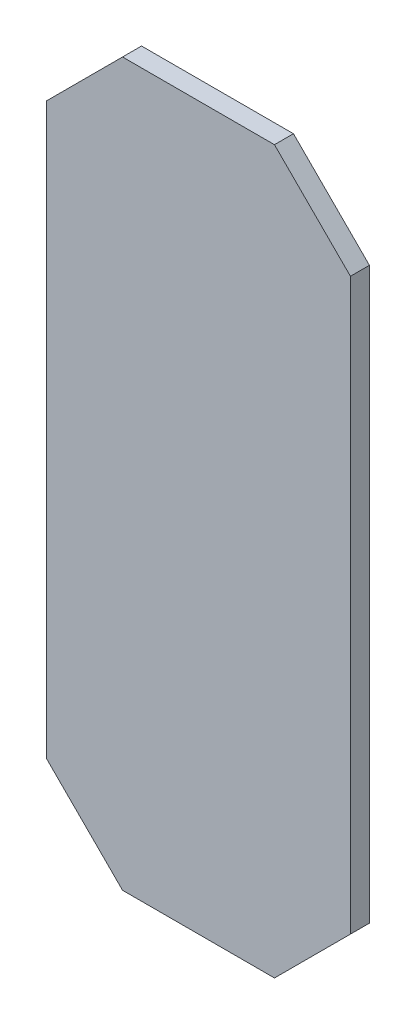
ISO-10303-21;
HEADER;
FILE_DESCRIPTION(('STEP AP214'),'2;1');
FILE_NAME('part.step','',(''),(''),'','','');
FILE_SCHEMA(('AUTOMOTIVE_DESIGN { 1 0 10303 214 1 1 1 1 }'));
ENDSEC;
DATA;
#1=APPLICATION_CONTEXT('core data for automotive mechanical design processes');
#2=APPLICATION_PROTOCOL_DEFINITION('international standard','automotive_design',2000,#1);
#3=PRODUCT_CONTEXT('',#1,'mechanical');
#4=PRODUCT('Part','Part','',(#3));
#5=PRODUCT_RELATED_PRODUCT_CATEGORY('part','',(#4));
#6=PRODUCT_DEFINITION_FORMATION('','',#4);
#7=PRODUCT_DEFINITION_CONTEXT('part definition',#1,'design');
#8=PRODUCT_DEFINITION('design','',#6,#7);
#9=PRODUCT_DEFINITION_SHAPE('','',#8);
#10=(LENGTH_UNIT() NAMED_UNIT(*) SI_UNIT(.MILLI.,.METRE.));
#11=(NAMED_UNIT(*) PLANE_ANGLE_UNIT() SI_UNIT($,.RADIAN.));
#12=(NAMED_UNIT(*) SI_UNIT($,.STERADIAN.) SOLID_ANGLE_UNIT());
#13=UNCERTAINTY_MEASURE_WITH_UNIT(LENGTH_MEASURE(1.E-05),#10,'distance_accuracy_value','');
#14=(GEOMETRIC_REPRESENTATION_CONTEXT(3) GLOBAL_UNCERTAINTY_ASSIGNED_CONTEXT((#13)) GLOBAL_UNIT_ASSIGNED_CONTEXT((#10,
#11,#12)) REPRESENTATION_CONTEXT('',''));
#15=CARTESIAN_POINT('',(0.,0.,0.));
#16=DIRECTION('',(0.,0.,1.));
#17=DIRECTION('',(1.,0.,0.));
#18=AXIS2_PLACEMENT_3D('',#15,#16,#17);
#19=CARTESIAN_POINT('',(-40.,95.,5.));
#20=DIRECTION('',(1.,0.,0.));
#21=DIRECTION('',(0.,1.,0.));
#22=AXIS2_PLACEMENT_3D('',#19,#20,#21);
#23=PLANE('',#22);
#24=DIRECTION('',(0.,-1.,0.));
#25=VECTOR('',#24,1.);
#26=CARTESIAN_POINT('',(-40.,95.,0.));
#27=LINE('',#26,#25);
#28=CARTESIAN_POINT('',(-40.,75.,0.));
#29=VERTEX_POINT('',#28);
#30=CARTESIAN_POINT('',(-40.,-74.9999999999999,0.));
#31=VERTEX_POINT('',#30);
#32=EDGE_CURVE('E131',#29,#31,#27,.T.);
#33=ORIENTED_EDGE('',*,*,#32,.T.);
#34=DIRECTION('',(0.,0.,1.));
#35=VECTOR('',#34,1.);
#36=CARTESIAN_POINT('',(-40.,-74.9999999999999,5.));
#37=LINE('',#36,#35);
#38=CARTESIAN_POINT('',(-40.,-74.9999999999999,5.));
#39=VERTEX_POINT('',#38);
#40=EDGE_CURVE('E154',#31,#39,#37,.T.);
#41=ORIENTED_EDGE('',*,*,#40,.T.);
#42=DIRECTION('',(0.,-1.,0.));
#43=VECTOR('',#42,1.);
#44=CARTESIAN_POINT('',(-40.,95.,5.));
#45=LINE('',#44,#43);
#46=CARTESIAN_POINT('',(-40.,75.,5.));
#47=VERTEX_POINT('',#46);
#48=EDGE_CURVE('E129',#47,#39,#45,.T.);
#49=ORIENTED_EDGE('',*,*,#48,.F.);
#50=DIRECTION('',(0.,0.,-1.));
#51=VECTOR('',#50,1.);
#52=CARTESIAN_POINT('',(-40.,75.,5.));
#53=LINE('',#52,#51);
#54=EDGE_CURVE('E151',#47,#29,#53,.T.);
#55=ORIENTED_EDGE('',*,*,#54,.T.);
#56=EDGE_LOOP('',(#33,#41,#49,#55));
#57=FACE_BOUND('',#56,.T.);
#58=ADVANCED_FACE('F36',(#57),#23,.F.);
#59=CARTESIAN_POINT('',(-40.,-95.,5.));
#60=DIRECTION('',(0.,1.,0.));
#61=DIRECTION('',(0.,0.,1.));
#62=AXIS2_PLACEMENT_3D('',#59,#60,#61);
#63=PLANE('',#62);
#64=DIRECTION('',(1.,0.,0.));
#65=VECTOR('',#64,1.);
#66=CARTESIAN_POINT('',(-40.,-95.,0.));
#67=LINE('',#66,#65);
#68=CARTESIAN_POINT('',(-20.,-95.,0.));
#69=VERTEX_POINT('',#68);
#70=CARTESIAN_POINT('',(20.,-95.,0.));
#71=VERTEX_POINT('',#70);
#72=EDGE_CURVE('E127',#69,#71,#67,.T.);
#73=ORIENTED_EDGE('',*,*,#72,.T.);
#74=DIRECTION('',(0.,0.,1.));
#75=VECTOR('',#74,1.);
#76=CARTESIAN_POINT('',(20.,-95.,5.));
#77=LINE('',#76,#75);
#78=CARTESIAN_POINT('',(20.,-95.,5.));
#79=VERTEX_POINT('',#78);
#80=EDGE_CURVE('E106',#71,#79,#77,.T.);
#81=ORIENTED_EDGE('',*,*,#80,.T.);
#82=DIRECTION('',(1.,0.,0.));
#83=VECTOR('',#82,1.);
#84=CARTESIAN_POINT('',(-40.,-95.,5.));
#85=LINE('',#84,#83);
#86=CARTESIAN_POINT('',(-20.,-95.,5.));
#87=VERTEX_POINT('',#86);
#88=EDGE_CURVE('E170',#87,#79,#85,.T.);
#89=ORIENTED_EDGE('',*,*,#88,.F.);
#90=DIRECTION('',(0.,0.,-1.));
#91=VECTOR('',#90,1.);
#92=CARTESIAN_POINT('',(-20.,-95.,5.));
#93=LINE('',#92,#91);
#94=EDGE_CURVE('E111',#87,#69,#93,.T.);
#95=ORIENTED_EDGE('',*,*,#94,.T.);
#96=EDGE_LOOP('',(#73,#81,#89,#95));
#97=FACE_BOUND('',#96,.T.);
#98=ADVANCED_FACE('F187',(#97),#63,.F.);
#99=CARTESIAN_POINT('',(40.,95.,5.));
#100=DIRECTION('',(-1.,0.,0.));
#101=DIRECTION('',(0.,-1.,0.));
#102=AXIS2_PLACEMENT_3D('',#99,#100,#101);
#103=PLANE('',#102);
#104=DIRECTION('',(0.,1.,0.));
#105=VECTOR('',#104,1.);
#106=CARTESIAN_POINT('',(40.,95.,5.));
#107=LINE('',#106,#105);
#108=CARTESIAN_POINT('',(40.,-75.0000000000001,5.));
#109=VERTEX_POINT('',#108);
#110=CARTESIAN_POINT('',(40.,74.9999999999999,5.));
#111=VERTEX_POINT('',#110);
#112=EDGE_CURVE('E120',#109,#111,#107,.T.);
#113=ORIENTED_EDGE('',*,*,#112,.F.);
#114=DIRECTION('',(0.,0.,-1.));
#115=VECTOR('',#114,1.);
#116=CARTESIAN_POINT('',(40.,-75.0000000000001,5.));
#117=LINE('',#116,#115);
#118=CARTESIAN_POINT('',(40.,-75.0000000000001,0.));
#119=VERTEX_POINT('',#118);
#120=EDGE_CURVE('E105',#109,#119,#117,.T.);
#121=ORIENTED_EDGE('',*,*,#120,.T.);
#122=DIRECTION('',(0.,1.,0.));
#123=VECTOR('',#122,1.);
#124=CARTESIAN_POINT('',(40.,95.,0.));
#125=LINE('',#124,#123);
#126=CARTESIAN_POINT('',(40.,74.9999999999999,0.));
#127=VERTEX_POINT('',#126);
#128=EDGE_CURVE('E118',#119,#127,#125,.T.);
#129=ORIENTED_EDGE('',*,*,#128,.T.);
#130=DIRECTION('',(0.,0.,1.));
#131=VECTOR('',#130,1.);
#132=CARTESIAN_POINT('',(40.,74.9999999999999,5.));
#133=LINE('',#132,#131);
#134=EDGE_CURVE('E122',#127,#111,#133,.T.);
#135=ORIENTED_EDGE('',*,*,#134,.T.);
#136=EDGE_LOOP('',(#113,#121,#129,#135));
#137=FACE_BOUND('',#136,.T.);
#138=ADVANCED_FACE('F117',(#137),#103,.F.);
#139=CARTESIAN_POINT('',(-40.,95.,5.));
#140=DIRECTION('',(0.,-1.,0.));
#141=DIRECTION('',(0.,0.,-1.));
#142=AXIS2_PLACEMENT_3D('',#139,#140,#141);
#143=PLANE('',#142);
#144=DIRECTION('',(-1.,0.,0.));
#145=VECTOR('',#144,1.);
#146=CARTESIAN_POINT('',(-40.,95.,0.));
#147=LINE('',#146,#145);
#148=CARTESIAN_POINT('',(20.,95.,0.));
#149=VERTEX_POINT('',#148);
#150=CARTESIAN_POINT('',(-20.,95.,0.));
#151=VERTEX_POINT('',#150);
#152=EDGE_CURVE('E126',#149,#151,#147,.T.);
#153=ORIENTED_EDGE('',*,*,#152,.T.);
#154=DIRECTION('',(0.,0.,1.));
#155=VECTOR('',#154,1.);
#156=CARTESIAN_POINT('',(-20.,95.,5.));
#157=LINE('',#156,#155);
#158=CARTESIAN_POINT('',(-20.,95.,5.));
#159=VERTEX_POINT('',#158);
#160=EDGE_CURVE('E11',#151,#159,#157,.T.);
#161=ORIENTED_EDGE('',*,*,#160,.T.);
#162=DIRECTION('',(-1.,0.,0.));
#163=VECTOR('',#162,1.);
#164=CARTESIAN_POINT('',(-40.,95.,5.));
#165=LINE('',#164,#163);
#166=CARTESIAN_POINT('',(20.,95.,5.));
#167=VERTEX_POINT('',#166);
#168=EDGE_CURVE('E135',#167,#159,#165,.T.);
#169=ORIENTED_EDGE('',*,*,#168,.F.);
#170=DIRECTION('',(0.,0.,-1.));
#171=VECTOR('',#170,1.);
#172=CARTESIAN_POINT('',(20.,95.,5.));
#173=LINE('',#172,#171);
#174=EDGE_CURVE('E44',#167,#149,#173,.T.);
#175=ORIENTED_EDGE('',*,*,#174,.T.);
#176=EDGE_LOOP('',(#153,#161,#169,#175));
#177=FACE_BOUND('',#176,.T.);
#178=ADVANCED_FACE('F157',(#177),#143,.F.);
#179=CARTESIAN_POINT('',(-40.,-95.,5.));
#180=DIRECTION('',(0.,0.,1.));
#181=DIRECTION('',(1.,0.,0.));
#182=AXIS2_PLACEMENT_3D('',#179,#180,#181);
#183=PLANE('',#182);
#184=ORIENTED_EDGE('',*,*,#88,.T.);
#185=DIRECTION('',(-0.707106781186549,-0.707106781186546,0.));
#186=VECTOR('',#185,1.);
#187=CARTESIAN_POINT('',(-10.0000000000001,-125.,5.));
#188=LINE('',#187,#186);
#189=EDGE_CURVE('E149',#79,#109,#188,.F.);
#190=ORIENTED_EDGE('',*,*,#189,.T.);
#191=ORIENTED_EDGE('',*,*,#112,.T.);
#192=DIRECTION('',(0.707106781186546,-0.707106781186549,0.));
#193=VECTOR('',#192,1.);
#194=CARTESIAN_POINT('',(85.0000000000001,29.9999999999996,5.));
#195=LINE('',#194,#193);
#196=EDGE_CURVE('E56',#111,#167,#195,.F.);
#197=ORIENTED_EDGE('',*,*,#196,.T.);
#198=ORIENTED_EDGE('',*,*,#168,.T.);
#199=DIRECTION('',(0.707106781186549,0.707106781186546,0.));
#200=VECTOR('',#199,1.);
#201=CARTESIAN_POINT('',(-125.,-9.99999999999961,5.));
#202=LINE('',#201,#200);
#203=EDGE_CURVE('E145',#159,#47,#202,.F.);
#204=ORIENTED_EDGE('',*,*,#203,.T.);
#205=ORIENTED_EDGE('',*,*,#48,.T.);
#206=DIRECTION('',(-0.707106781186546,0.707106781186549,0.));
#207=VECTOR('',#206,1.);
#208=CARTESIAN_POINT('',(-30.,-85.,5.));
#209=LINE('',#208,#207);
#210=EDGE_CURVE('E147',#39,#87,#209,.F.);
#211=ORIENTED_EDGE('',*,*,#210,.T.);
#212=EDGE_LOOP('',(#184,#190,#191,#197,#198,#204,#205,#211));
#213=FACE_BOUND('',#212,.T.);
#214=ADVANCED_FACE('F176',(#213),#183,.T.);
#215=CARTESIAN_POINT('',(-40.,-95.,0.));
#216=DIRECTION('',(0.,0.,1.));
#217=DIRECTION('',(1.,0.,0.));
#218=AXIS2_PLACEMENT_3D('',#215,#216,#217);
#219=PLANE('',#218);
#220=ORIENTED_EDGE('',*,*,#128,.F.);
#221=DIRECTION('',(0.707106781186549,0.707106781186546,0.));
#222=VECTOR('',#221,1.);
#223=CARTESIAN_POINT('',(40.,-75.0000000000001,0.));
#224=LINE('',#223,#222);
#225=EDGE_CURVE('E101',#119,#71,#224,.F.);
#226=ORIENTED_EDGE('',*,*,#225,.T.);
#227=ORIENTED_EDGE('',*,*,#72,.F.);
#228=DIRECTION('',(0.707106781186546,-0.707106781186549,0.));
#229=VECTOR('',#228,1.);
#230=CARTESIAN_POINT('',(-20.,-95.,0.));
#231=LINE('',#230,#229);
#232=EDGE_CURVE('E112',#69,#31,#231,.F.);
#233=ORIENTED_EDGE('',*,*,#232,.T.);
#234=ORIENTED_EDGE('',*,*,#32,.F.);
#235=DIRECTION('',(-0.707106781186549,-0.707106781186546,0.));
#236=VECTOR('',#235,1.);
#237=CARTESIAN_POINT('',(-40.,75.,0.));
#238=LINE('',#237,#236);
#239=EDGE_CURVE('E138',#29,#151,#238,.F.);
#240=ORIENTED_EDGE('',*,*,#239,.T.);
#241=ORIENTED_EDGE('',*,*,#152,.F.);
#242=DIRECTION('',(-0.707106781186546,0.707106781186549,0.));
#243=VECTOR('',#242,1.);
#244=CARTESIAN_POINT('',(20.,95.,0.));
#245=LINE('',#244,#243);
#246=EDGE_CURVE('E121',#149,#127,#245,.F.);
#247=ORIENTED_EDGE('',*,*,#246,.T.);
#248=EDGE_LOOP('',(#220,#226,#227,#233,#234,#240,#241,#247));
#249=FACE_BOUND('',#248,.T.);
#250=ADVANCED_FACE('F124',(#249),#219,.F.);
#251=CARTESIAN_POINT('',(40.,-75.0000000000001,5.));
#252=DIRECTION('',(-0.707106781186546,0.707106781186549,0.));
#253=DIRECTION('',(-0.707106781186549,-0.707106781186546,0.));
#254=AXIS2_PLACEMENT_3D('',#251,#252,#253);
#255=PLANE('',#254);
#256=ORIENTED_EDGE('',*,*,#189,.F.);
#257=ORIENTED_EDGE('',*,*,#80,.F.);
#258=ORIENTED_EDGE('',*,*,#225,.F.);
#259=ORIENTED_EDGE('',*,*,#120,.F.);
#260=EDGE_LOOP('',(#256,#257,#258,#259));
#261=FACE_BOUND('',#260,.T.);
#262=ADVANCED_FACE('F104',(#261),#255,.F.);
#263=CARTESIAN_POINT('',(-20.,-95.,5.));
#264=DIRECTION('',(0.707106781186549,0.707106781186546,0.));
#265=DIRECTION('',(-0.707106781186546,0.707106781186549,0.));
#266=AXIS2_PLACEMENT_3D('',#263,#264,#265);
#267=PLANE('',#266);
#268=ORIENTED_EDGE('',*,*,#210,.F.);
#269=ORIENTED_EDGE('',*,*,#40,.F.);
#270=ORIENTED_EDGE('',*,*,#232,.F.);
#271=ORIENTED_EDGE('',*,*,#94,.F.);
#272=EDGE_LOOP('',(#268,#269,#270,#271));
#273=FACE_BOUND('',#272,.T.);
#274=ADVANCED_FACE('F198',(#273),#267,.F.);
#275=CARTESIAN_POINT('',(-40.,75.,5.));
#276=DIRECTION('',(0.707106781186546,-0.707106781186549,0.));
#277=DIRECTION('',(0.707106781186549,0.707106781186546,0.));
#278=AXIS2_PLACEMENT_3D('',#275,#276,#277);
#279=PLANE('',#278);
#280=ORIENTED_EDGE('',*,*,#203,.F.);
#281=ORIENTED_EDGE('',*,*,#160,.F.);
#282=ORIENTED_EDGE('',*,*,#239,.F.);
#283=ORIENTED_EDGE('',*,*,#54,.F.);
#284=EDGE_LOOP('',(#280,#281,#282,#283));
#285=FACE_BOUND('',#284,.T.);
#286=ADVANCED_FACE('F164',(#285),#279,.F.);
#287=CARTESIAN_POINT('',(20.,95.,5.));
#288=DIRECTION('',(-0.707106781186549,-0.707106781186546,0.));
#289=DIRECTION('',(0.707106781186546,-0.707106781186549,0.));
#290=AXIS2_PLACEMENT_3D('',#287,#288,#289);
#291=PLANE('',#290);
#292=ORIENTED_EDGE('',*,*,#196,.F.);
#293=ORIENTED_EDGE('',*,*,#134,.F.);
#294=ORIENTED_EDGE('',*,*,#246,.F.);
#295=ORIENTED_EDGE('',*,*,#174,.F.);
#296=EDGE_LOOP('',(#292,#293,#294,#295));
#297=FACE_BOUND('',#296,.T.);
#298=ADVANCED_FACE('F38',(#297),#291,.F.);
#299=CLOSED_SHELL('',(#58,#98,#138,#178,#214,#250,#262,#274,#286,#298));
#300=MANIFOLD_SOLID_BREP('B2',#299);
#301=ADVANCED_BREP_SHAPE_REPRESENTATION('',(#18,#300),#14);
#302=SHAPE_DEFINITION_REPRESENTATION(#9,#301);
ENDSEC;
END-ISO-10303-21;
